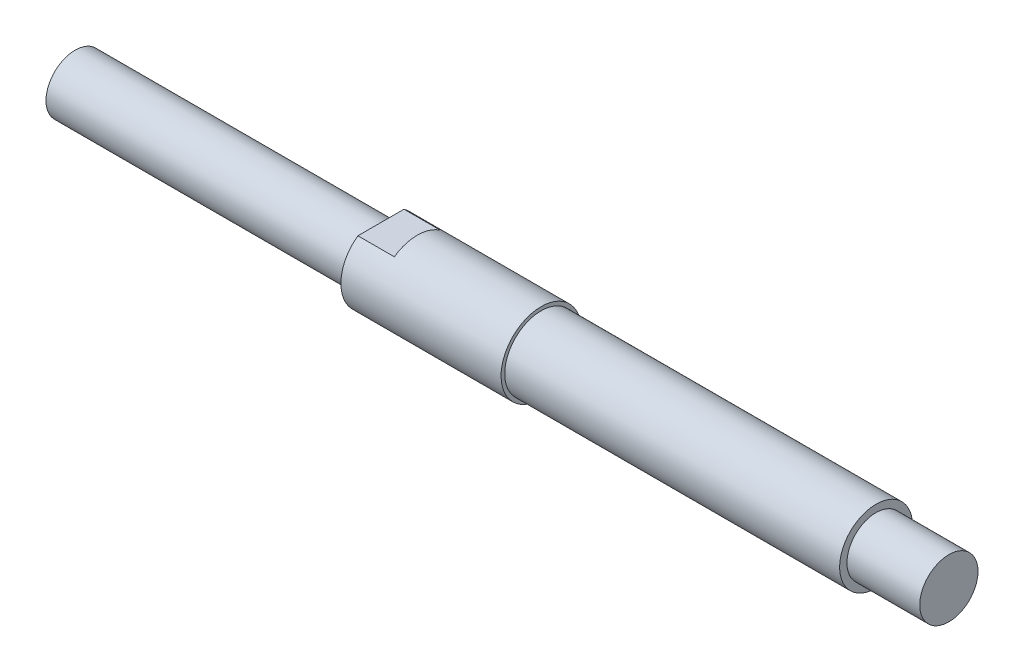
from build123d import *

# Parameters (mm, degrees)
ESQUISSE1_W                  = 60
ESQUISSE1_H                  = 2.75
ENL_V_START                  = -5
ESQUISSE2_R                  = 2.75
ESQUISSE2_R_2                = 2
ENL_V_MAT_EXTRU_1_DEPTH      = 5
ENL_V_START_2                = -23
ESQUISSE3_R                  = 2.75
ESQUISSE3_R_2                = 2.5
ENL_V_MAT_EXTRU_2_DEPTH      = 23
ESQUISSE4_R                  = 2.75
ESQUISSE4_R_2                = 2
ENL_V_MAT_EXTRU_3_DEPTH      = 21
ESQUISSE5_W                  = 2.5
ESQUISSE5_H                  = 5.399649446
ENL_V_MAT_EXTRU_5_DEPTH      = 0.5
ESQUISSE6_W                  = 3.5
ESQUISSE6_H                  = 5
ENL_V_MAT_EXTRU_7_DEPTH      = 0.5
R_P_TITION_CIRCULAIRE1_COUNT = 2


with BuildPart() as part:
    # Esquisse1 → R_volution1 (revolve)
    with BuildSketch(Plane.XY, mode=Mode.PRIVATE) as r_volution1_sk:
        with Locations((30, 1.375)):
            Rectangle(ESQUISSE1_W, ESQUISSE1_H)
    revolve(r_volution1_sk.sketch.rotate(Axis((-2.912919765, 0, 0), (1, 0, 0)), 90), axis=Axis((-2.912919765, 0, 0), (1, 0, 0)))

    # Esquisse2 → Enl_v. mat.-Extru.1 (cut)
    with BuildSketch(Plane(origin=(60, 0, 0), x_dir=(0, 0, -1), z_dir=(1, 0, 0)).offset(ENL_V_START)):
        with Locations(Location((0, 0, 0), (0, 0, 180))):
            Circle(ESQUISSE2_R)
        Circle(ESQUISSE2_R_2, mode=Mode.SUBTRACT)
    extrude(amount=ENL_V_MAT_EXTRU_1_DEPTH, mode=Mode.SUBTRACT)

    # Esquisse3 → Enl_v. mat.-Extru.2 (cut)
    with BuildSketch(Plane(origin=(55, 0, 0), x_dir=(0, 0, -1), z_dir=(1, 0, 0)).offset(ENL_V_START_2)):
        with Locations(Location((0, 0, 0), (0, 0, 180))):
            Circle(ESQUISSE3_R)
        Circle(ESQUISSE3_R_2, mode=Mode.SUBTRACT)
    extrude(amount=ENL_V_MAT_EXTRU_2_DEPTH, mode=Mode.SUBTRACT)

    # Esquisse4 → Enl_v. mat.-Extru.3 (cut)
    with BuildSketch(Plane.ZY):
        Circle(ESQUISSE4_R)
        with Locations(Location((0, 0, 0), (0, 0, 180))):
            Circle(ESQUISSE4_R_2, mode=Mode.SUBTRACT)
    extrude(amount=-ENL_V_MAT_EXTRU_3_DEPTH, mode=Mode.SUBTRACT)

    # Esquisse5 → Enl_v. mat.-Extru.5 (cut)
    with BuildSketch(Plane(origin=(0, -2.75, 0), x_dir=(1, 0, 0), z_dir=(0, 1, 0))):
        with Locations((22.25, -0.050175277)):
            Rectangle(ESQUISSE5_W, ESQUISSE5_H)
    enl_v_mat_extru_5 = extrude(amount=ENL_V_MAT_EXTRU_5_DEPTH, mode=Mode.SUBTRACT)

    # Esquisse6 → Enl_v. mat.-Extru.7 (cut)
    with BuildSketch(Plane(origin=(0, -2.75, 0), x_dir=(1, 0, 0), z_dir=(0, 1, 0))):
        with Locations((38.25, 0)):
            Rectangle(ESQUISSE6_W, ESQUISSE6_H)
    extrude(amount=ENL_V_MAT_EXTRU_7_DEPTH, mode=Mode.SUBTRACT)

    # R_p_tition circulaire1: Enl_v. mat.-Extru.5 ×2 about axis
    r_p_tition_circulaire1_axis = Axis((-2.793723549, 0, 0), (1, 0, 0))
    for i in range(1, R_P_TITION_CIRCULAIRE1_COUNT):
        add(enl_v_mat_extru_5.rotate(r_p_tition_circulaire1_axis, i * 360 / R_P_TITION_CIRCULAIRE1_COUNT), mode=Mode.SUBTRACT)


solid = part.part
